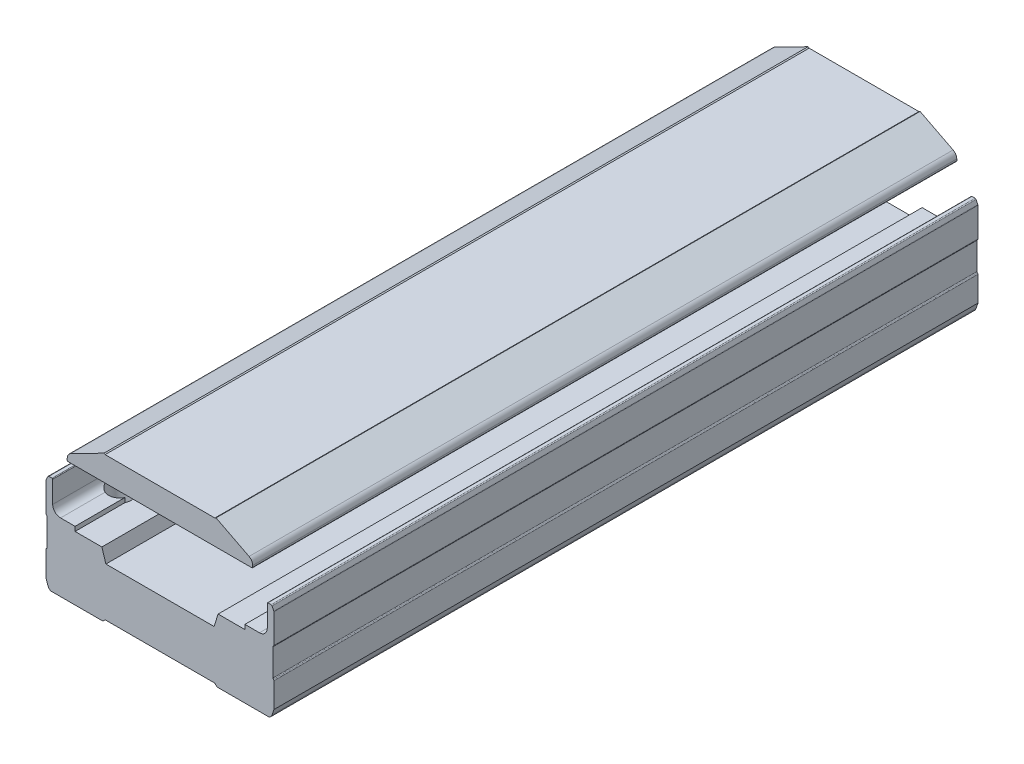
from build123d import *

# Parameters (mm, degrees)
EXTRUDE_1_DEPTH             = 315
EXTRUDE_1_2_DEPTH           = 315
HOLE_WIZARD_1_AT_2_COUNT    = 2
HOLE_WIZARD_1_AT_2_PITCH    = 50
HOLE_WIZARD_1_AT_3_COUNT    = 2
HOLE_WIZARD_1_AT_3_PITCH    = 250
HOLE_WIZARD_1_AT_4_COUNT    = 2
HOLE_WIZARD_1_AT_4_PITCH    = 264.05491853
HOLE_WIZARD_1_AT_5_COUNT    = 2
HOLE_WIZARD_1_AT_5_PITCH    = 98.615414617
HOLE_WIZARD_1_AT_6_COUNT    = 2
HOLE_WIZARD_1_AT_6_PITCH    = 85
HOLE_WIZARD_M5_1_AT_2_COUNT = 2
HOLE_WIZARD_M5_1_AT_2_PITCH = 85
HOLE_WIZARD_M5_1_AT_3_COUNT = 2
HOLE_WIZARD_M5_1_AT_3_PITCH = 50
HOLE_WIZARD_M5_1_AT_4_COUNT = 2
HOLE_WIZARD_M5_1_AT_4_PITCH = 250
HOLE_WIZARD_M5_1_AT_5_COUNT = 2
HOLE_WIZARD_M5_1_AT_5_PITCH = 264.05491853
HOLE_WIZARD_M5_1_AT_6_COUNT = 2
HOLE_WIZARD_M5_1_AT_6_PITCH = 98.615414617


with BuildPart() as part:
    # Sketch 1 → Extrude 1 (new body)
    with BuildSketch(Plane.XY):
        with BuildLine():
            Line((41.5, 53.4), (41.5, 54.091597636))
            ThreePointArc((41.5, 54.091597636), (41.057920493, 55.65909333), (39.861971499, 56.764617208))
            Line((39.861971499, 56.764617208), (25.072950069, 64.3))
            Line((25.072950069, 64.3), (24.553334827, 64))
            Line((24.553334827, 64), (-24.553334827, 64))
            Line((-24.553334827, 64), (-25.072950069, 64.3))
            Line((-25.072950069, 64.3), (-39.861971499, 56.764617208))
            ThreePointArc((-39.861971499, 56.764617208), (-41.057920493, 55.65909333), (-41.5, 54.091597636))
            Line((-41.5, 54.091597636), (-41.5, 53.4))
            ThreePointArc((-41.5, 53.4), (-41.382842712, 53.117157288), (-41.1, 53))
            Line((-41.1, 53), (41.1, 53))
            ThreePointArc((41.1, 53), (41.382842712, 53.117157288), (41.5, 53.4))
        make_face()
    extrude(amount=EXTRUDE_1_DEPTH)


with BuildPart() as body_2:
    # Sketch 1 → Extrude 1 2 (new body)
    with BuildSketch(Plane.XY):
        with BuildLine():
            Line((-24.196643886, 21.780485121), (-26, 27.5))
            Line((-26, 27.5), (-38, 27.5))
            Line((-38, 27.5), (-38, 29.5))
            Line((-38, 29.5), (-44.5, 29.5))
            ThreePointArc((-44.5, 29.5), (-46.974873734, 30.525126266), (-48, 33))
            Line((-48, 33), (-48, 42.7))
            ThreePointArc((-48, 42.7), (-48.087867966, 42.912132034), (-48.3, 43))
            Line((-48.3, 43), (-49.690983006, 43))
            ThreePointArc((-49.690983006, 43), (-49.953848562, 42.925325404), (-50.138196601, 42.723606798))
            Line((-50.138196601, 42.723606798), (-50.947213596, 41.105572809))
            ThreePointArc((-50.947213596, 41.105572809), (-50.986624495, 40.996842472), (-51, 40.881966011))
            Line((-51, 40.881966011), (-51, 27.866025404))
            ThreePointArc((-51, 27.866025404), (-50.933012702, 27.616025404), (-50.75, 27.433012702))
            ThreePointArc((-50.75, 27.433012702), (-50.566987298, 27.25), (-50.5, 27))
            Line((-50.5, 27), (-50.5, 15))
            ThreePointArc((-50.5, 15), (-50.566987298, 14.75), (-50.75, 14.566987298))
            ThreePointArc((-50.75, 14.566987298), (-50.933012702, 14.383974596), (-51, 14.133974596))
            Line((-51, 14.133974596), (-51, 3))
            Line((-51, 3), (-50.137801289, 0.495993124))
            ThreePointArc((-50.137801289, 0.495993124), (-49.689081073, -0.343408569), (-49, -1))
            Line((-49, -1), (-25.5, -1))
            Line((-25.5, -1), (-24.5, 0))
            Line((-24.5, 0), (24.5, 0))
            Line((24.5, 0), (25.5, -1))
            Line((25.5, -1), (49, -1))
            ThreePointArc((49, -1), (49.689081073, -0.343408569), (50.137801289, 0.495993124))
            Line((50.137801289, 0.495993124), (51, 3))
            Line((51, 3), (51, 14.133974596))
            ThreePointArc((51, 14.133974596), (50.933012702, 14.383974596), (50.75, 14.566987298))
            ThreePointArc((50.75, 14.566987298), (50.566987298, 14.75), (50.5, 15))
            Line((50.5, 15), (50.5, 27))
            ThreePointArc((50.5, 27), (50.566987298, 27.25), (50.75, 27.433012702))
            ThreePointArc((50.75, 27.433012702), (50.933012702, 27.616025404), (51, 27.866025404))
            Line((51, 27.866025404), (51, 40.881966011))
            ThreePointArc((51, 40.881966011), (50.986624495, 40.996842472), (50.947213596, 41.105572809))
            Line((50.947213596, 41.105572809), (50.138196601, 42.723606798))
            ThreePointArc((50.138196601, 42.723606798), (49.953848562, 42.925325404), (49.690983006, 43))
            Line((49.690983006, 43), (48.3, 43))
            ThreePointArc((48.3, 43), (48.087867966, 42.912132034), (48, 42.7))
            Line((48, 42.7), (48, 33))
            ThreePointArc((48, 33), (46.974873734, 30.525126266), (44.5, 29.5))
            Line((44.5, 29.5), (38, 29.5))
            Line((38, 29.5), (38, 27.5))
            Line((38, 27.5), (26, 27.5))
            Line((26, 27.5), (24.196643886, 21.780485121))
            Line((24.196643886, 21.780485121), (-24.196643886, 21.780485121))
        make_face()
    extrude(amount=EXTRUDE_1_2_DEPTH)

    # Sketch 5 → Hole Wizard 1 (revolve, cut)
    with BuildSketch(Plane(origin=(-42.5, 43, 40.5), x_dir=(0, 0, 1), z_dir=(1, 0, 0))):
        Polygon((0, 0), (0, 44), (2.75, 44), (2.75, 30.5), (5, 30.5), (5, 0), align=None)
    hole_wizard_1 = revolve(axis=Axis((-42.5, 49.35, 40.5), (0, -1, 0)), mode=Mode.SUBTRACT)

    # Hole Wizard 1 at 2: Hole Wizard 1 ×2
    with Locations(*[(0, 0, i * HOLE_WIZARD_1_AT_2_PITCH) for i in range(1, HOLE_WIZARD_1_AT_2_COUNT)]):
        add(hole_wizard_1, mode=Mode.SUBTRACT)

    # Hole Wizard 1 at 3: Hole Wizard 1 ×2
    with Locations(*[(0, 0, i * HOLE_WIZARD_1_AT_3_PITCH) for i in range(1, HOLE_WIZARD_1_AT_3_COUNT)]):
        add(hole_wizard_1, mode=Mode.SUBTRACT)

    # Hole Wizard 1 at 4: Hole Wizard 1 ×2
    with Locations(*[Vector(0.32190273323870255, 0, 0.9467727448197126) * (i * HOLE_WIZARD_1_AT_4_PITCH) for i in range(1, HOLE_WIZARD_1_AT_4_COUNT)]):
        add(hole_wizard_1, mode=Mode.SUBTRACT)

    # Hole Wizard 1 at 5: Hole Wizard 1 ×2
    with Locations(*[Vector(0.8619342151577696, 0, 0.5070201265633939) * (i * HOLE_WIZARD_1_AT_5_PITCH) for i in range(1, HOLE_WIZARD_1_AT_5_COUNT)]):
        add(hole_wizard_1, mode=Mode.SUBTRACT)

    # Hole Wizard 1 at 6: Hole Wizard 1 ×2
    with Locations(*[(i * HOLE_WIZARD_1_AT_6_PITCH, 0, 0) for i in range(1, HOLE_WIZARD_1_AT_6_COUNT)]):
        add(hole_wizard_1, mode=Mode.SUBTRACT)

    # Sketch 9 → Hole Wizard M5 _1 (revolve, cut)
    with BuildSketch(Plane(origin=(42.5, -1, 30.5), x_dir=(0, 0, -1), z_dir=(1, 0, 0))):
        Polygon((0, 0), (0, 12.2618073), (2.1, 11), (2.1, 0), align=None)
    hole_wizard_m5_1 = revolve(axis=Axis((42.5, -7.35, 30.5), (0, 1, 0)), mode=Mode.SUBTRACT)

    # Hole Wizard M5 _1 at 2: Hole Wizard M5 _1 ×2
    with Locations(*[(-i * HOLE_WIZARD_M5_1_AT_2_PITCH, 0, 0) for i in range(1, HOLE_WIZARD_M5_1_AT_2_COUNT)]):
        add(hole_wizard_m5_1, mode=Mode.SUBTRACT)

    # Hole Wizard M5 _1 at 3: Hole Wizard M5 _1 ×2
    with Locations(*[(0, 0, i * HOLE_WIZARD_M5_1_AT_3_PITCH) for i in range(1, HOLE_WIZARD_M5_1_AT_3_COUNT)]):
        add(hole_wizard_m5_1, mode=Mode.SUBTRACT)

    # Hole Wizard M5 _1 at 4: Hole Wizard M5 _1 ×2
    with Locations(*[(0, 0, i * HOLE_WIZARD_M5_1_AT_4_PITCH) for i in range(1, HOLE_WIZARD_M5_1_AT_4_COUNT)]):
        add(hole_wizard_m5_1, mode=Mode.SUBTRACT)

    # Hole Wizard M5 _1 at 5: Hole Wizard M5 _1 ×2
    with Locations(*[Vector(-0.32190273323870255, 0, 0.9467727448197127) * (i * HOLE_WIZARD_M5_1_AT_5_PITCH) for i in range(1, HOLE_WIZARD_M5_1_AT_5_COUNT)]):
        add(hole_wizard_m5_1, mode=Mode.SUBTRACT)

    # Hole Wizard M5 _1 at 6: Hole Wizard M5 _1 ×2
    with Locations(*[Vector(-0.8619342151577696, 0, 0.5070201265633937) * (i * HOLE_WIZARD_M5_1_AT_6_PITCH) for i in range(1, HOLE_WIZARD_M5_1_AT_6_COUNT)]):
        add(hole_wizard_m5_1, mode=Mode.SUBTRACT)


solid = Compound([part.part, body_2.part])
